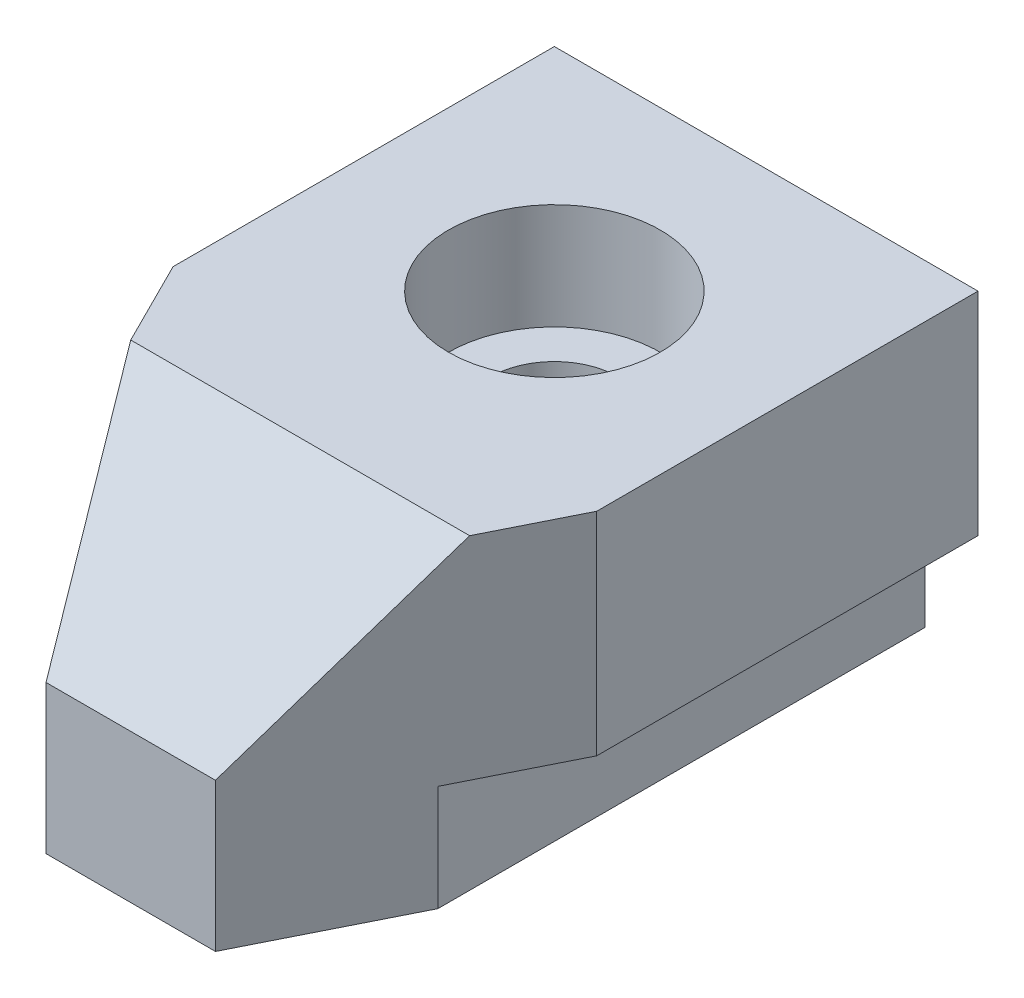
from build123d import *

# Parameters (mm, degrees)
SKETCH_1_W          = 30
SKETCH_1_H          = 15
EXTRUDE_1_DEPTH     = 20
CUT_EXTRUDE_1_DEPTH = 20
CUT_EXTRUDE_2_DEPTH = 10
SKETCH_6_W          = 2.5
SKETCH_6_H          = 5
CUT_EXTRUDE_3_DEPTH = 15


with BuildPart() as part:
    # Sketch 1 → Extrude 1 (new body)
    with BuildSketch(Plane(origin=(0, 0, 0), x_dir=(0, 0, -1), z_dir=(1, 0, 0))):
        Rectangle(SKETCH_1_W, SKETCH_1_H)
    extrude(amount=EXTRUDE_1_DEPTH)

    # Sketch 3 → Cut-Revolve 1 (revolve, cut)
    with BuildSketch(Plane(origin=(10, 0, 0), x_dir=(0, 0, -1), z_dir=(1, 0, 0))):
        Polygon((5, 7.523226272), (0, 7.5), (0, 2.5), (2, 2.5), (2, -7.5), (5, -7.5), align=None)
    revolve(axis=Axis((10, 10.15105742, -5), (0, -1, 0)), mode=Mode.SUBTRACT)

    # Sketch 4 → Cut-Extrude 1 (cut)
    with BuildSketch(Plane(origin=(20, 0, 0), x_dir=(0, 0, -1), z_dir=(1, 0, 0))):
        Polygon((-15, 7.5), (-15, -0.5), (-7, 7.5), align=None)
    extrude(amount=-CUT_EXTRUDE_1_DEPTH, mode=Mode.SUBTRACT)

    # Sketch 5 → Cut-Extrude 2 (cut, symmetric)
    with BuildSketch(Plane(origin=(0, 0, 0), x_dir=(1, 0, 0), z_dir=(0, 1, 0))):
        Polygon((0, -3), (6, -15), (0, -15), align=None)
        Polygon((14, -15), (20, -15), (20, -3), align=None)
    extrude(amount=CUT_EXTRUDE_2_DEPTH, both=True, mode=Mode.SUBTRACT)

    # Sketch 6 → Cut-Extrude 3 (cut, symmetric)
    with BuildSketch(Plane.XY):
        with Locations((1.25, -5)):
            Rectangle(SKETCH_6_W, SKETCH_6_H)
        with Locations((18.75, -5)):
            Rectangle(SKETCH_6_W, SKETCH_6_H)
    extrude(amount=CUT_EXTRUDE_3_DEPTH, both=True, mode=Mode.SUBTRACT)


solid = part.part
